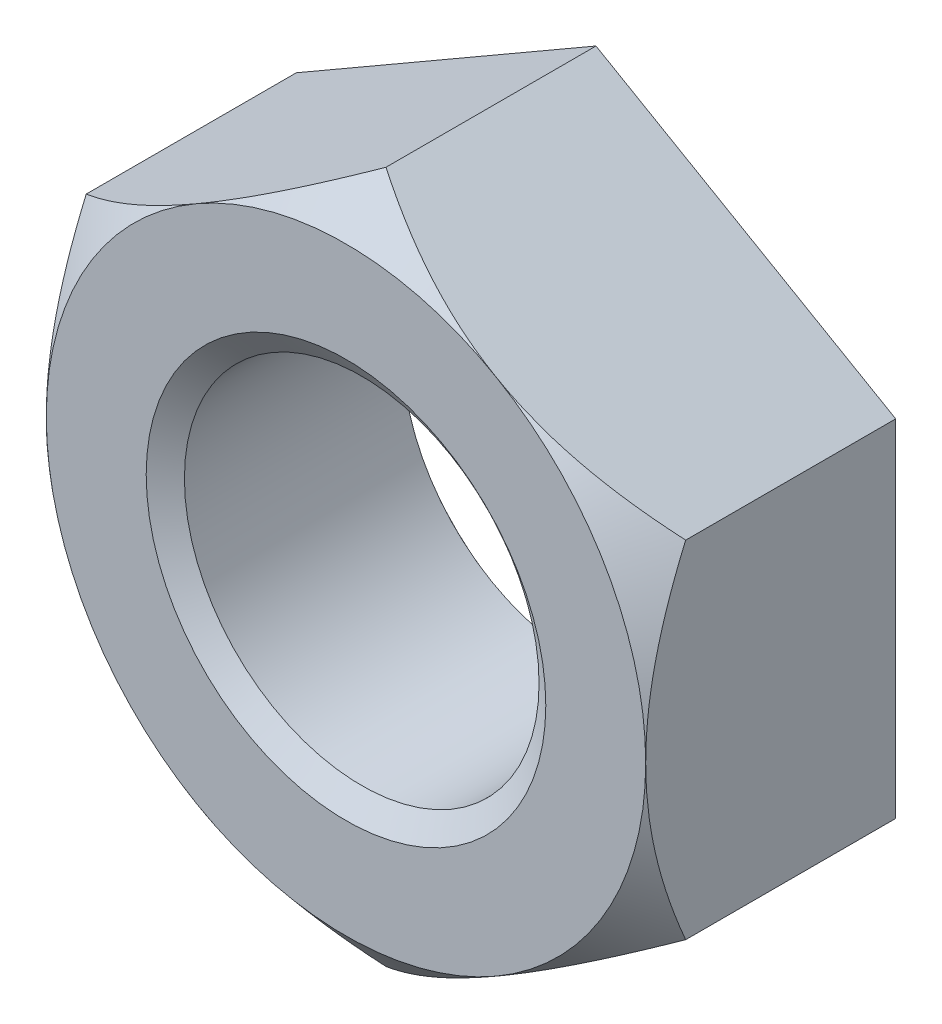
ISO-10303-21;
HEADER;
FILE_DESCRIPTION(('STEP AP214'),'2;1');
FILE_NAME('part.step','',(''),(''),'','','');
FILE_SCHEMA(('AUTOMOTIVE_DESIGN { 1 0 10303 214 1 1 1 1 }'));
ENDSEC;
DATA;
#1=APPLICATION_CONTEXT('core data for automotive mechanical design processes');
#2=APPLICATION_PROTOCOL_DEFINITION('international standard','automotive_design',2000,#1);
#3=PRODUCT_CONTEXT('',#1,'mechanical');
#4=PRODUCT('Part','Part','',(#3));
#5=PRODUCT_RELATED_PRODUCT_CATEGORY('part','',(#4));
#6=PRODUCT_DEFINITION_FORMATION('','',#4);
#7=PRODUCT_DEFINITION_CONTEXT('part definition',#1,'design');
#8=PRODUCT_DEFINITION('design','',#6,#7);
#9=PRODUCT_DEFINITION_SHAPE('','',#8);
#10=(LENGTH_UNIT() NAMED_UNIT(*) SI_UNIT(.MILLI.,.METRE.));
#11=(NAMED_UNIT(*) PLANE_ANGLE_UNIT() SI_UNIT($,.RADIAN.));
#12=(NAMED_UNIT(*) SI_UNIT($,.STERADIAN.) SOLID_ANGLE_UNIT());
#13=UNCERTAINTY_MEASURE_WITH_UNIT(LENGTH_MEASURE(1.E-05),#10,'distance_accuracy_value','');
#14=(GEOMETRIC_REPRESENTATION_CONTEXT(3) GLOBAL_UNCERTAINTY_ASSIGNED_CONTEXT((#13)) GLOBAL_UNIT_ASSIGNED_CONTEXT((#10,
#11,#12)) REPRESENTATION_CONTEXT('',''));
#15=CARTESIAN_POINT('',(0.,0.,0.));
#16=DIRECTION('',(0.,0.,1.));
#17=DIRECTION('',(1.,0.,0.));
#18=AXIS2_PLACEMENT_3D('',#15,#16,#17);
#19=CARTESIAN_POINT('',(0.,0.,-19.8628));
#20=DIRECTION('',(0.,0.,1.));
#21=DIRECTION('',(1.,0.,0.));
#22=AXIS2_PLACEMENT_3D('',#19,#20,#21);
#23=CYLINDRICAL_SURFACE('',#22,14.08938);
#24=CARTESIAN_POINT('',(0.,0.,-1.25030458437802));
#25=DIRECTION('',(0.,0.,1.));
#26=DIRECTION('',(1.,0.,0.));
#27=AXIS2_PLACEMENT_3D('',#24,#25,#26);
#28=CIRCLE('',#27,14.08938);
#29=CARTESIAN_POINT('',(14.08938,0.,-1.25030458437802));
#30=VERTEX_POINT('',#29);
#31=EDGE_CURVE('E131',#30,#30,#28,.F.);
#32=ORIENTED_EDGE('',*,*,#31,.F.);
#33=EDGE_LOOP('',(#32));
#34=FACE_BOUND('',#33,.T.);
#35=CARTESIAN_POINT('',(0.,0.,-18.587095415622));
#36=DIRECTION('',(0.,0.,-1.));
#37=DIRECTION('',(-1.,0.,0.));
#38=AXIS2_PLACEMENT_3D('',#35,#36,#37);
#39=CIRCLE('',#38,14.08938);
#40=CARTESIAN_POINT('',(-14.08938,0.,-18.587095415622));
#41=VERTEX_POINT('',#40);
#42=EDGE_CURVE('E38',#41,#41,#39,.F.);
#43=ORIENTED_EDGE('',*,*,#42,.F.);
#44=EDGE_LOOP('',(#43));
#45=FACE_BOUND('',#44,.T.);
#46=ADVANCED_FACE('F33',(#34,#45),#23,.F.);
#47=CARTESIAN_POINT('',(-47.625,0.,-19.8628));
#48=DIRECTION('',(0.,0.,1.));
#49=DIRECTION('',(1.,0.,0.));
#50=AXIS2_PLACEMENT_3D('',#47,#48,#49);
#51=PLANE('',#50);
#52=DIRECTION('',(-0.866025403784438,-0.500000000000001,0.));
#53=VECTOR('',#52,1.);
#54=CARTESIAN_POINT('',(0.,27.4963065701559,-19.8628));
#55=LINE('',#54,#53);
#56=CARTESIAN_POINT('',(0.,27.4963065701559,-19.8628));
#57=VERTEX_POINT('',#56);
#58=CARTESIAN_POINT('',(-23.8125,13.7481532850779,-19.8628));
#59=VERTEX_POINT('',#58);
#60=EDGE_CURVE('E140',#57,#59,#55,.T.);
#61=ORIENTED_EDGE('',*,*,#60,.F.);
#62=DIRECTION('',(-0.866025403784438,0.500000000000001,0.));
#63=VECTOR('',#62,1.);
#64=CARTESIAN_POINT('',(23.8125,13.7481532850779,-19.8628));
#65=LINE('',#64,#63);
#66=CARTESIAN_POINT('',(23.8125,13.7481532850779,-19.8628));
#67=VERTEX_POINT('',#66);
#68=EDGE_CURVE('E234',#67,#57,#65,.T.);
#69=ORIENTED_EDGE('',*,*,#68,.F.);
#70=DIRECTION('',(0.,-1.,0.));
#71=VECTOR('',#70,1.);
#72=CARTESIAN_POINT('',(23.8125,13.7481532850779,-19.8628));
#73=LINE('',#72,#71);
#74=CARTESIAN_POINT('',(23.8125,-13.748153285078,-19.8628));
#75=VERTEX_POINT('',#74);
#76=EDGE_CURVE('E396',#67,#75,#73,.T.);
#77=ORIENTED_EDGE('',*,*,#76,.T.);
#78=DIRECTION('',(0.866025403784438,0.500000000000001,0.));
#79=VECTOR('',#78,1.);
#80=CARTESIAN_POINT('',(0.,-27.496306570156,-19.8628));
#81=LINE('',#80,#79);
#82=CARTESIAN_POINT('',(0.,-27.496306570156,-19.8628));
#83=VERTEX_POINT('',#82);
#84=EDGE_CURVE('E394',#83,#75,#81,.T.);
#85=ORIENTED_EDGE('',*,*,#84,.F.);
#86=DIRECTION('',(0.866025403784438,-0.500000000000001,0.));
#87=VECTOR('',#86,1.);
#88=CARTESIAN_POINT('',(-23.8125,-13.748153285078,-19.8628));
#89=LINE('',#88,#87);
#90=CARTESIAN_POINT('',(-23.8125,-13.748153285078,-19.8628));
#91=VERTEX_POINT('',#90);
#92=EDGE_CURVE('E390',#91,#83,#89,.T.);
#93=ORIENTED_EDGE('',*,*,#92,.F.);
#94=DIRECTION('',(0.,-1.,0.));
#95=VECTOR('',#94,1.);
#96=CARTESIAN_POINT('',(-23.8125,13.7481532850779,-19.8628));
#97=LINE('',#96,#95);
#98=EDGE_CURVE('E142',#59,#91,#97,.T.);
#99=ORIENTED_EDGE('',*,*,#98,.F.);
#100=EDGE_LOOP('',(#61,#69,#77,#85,#93,#99));
#101=FACE_BOUND('',#100,.T.);
#102=CARTESIAN_POINT('',(0.,0.,-19.8628));
#103=DIRECTION('',(0.,0.,1.));
#104=DIRECTION('',(1.,0.,0.));
#105=AXIS2_PLACEMENT_3D('',#102,#103,#104);
#106=CIRCLE('',#105,15.875);
#107=CARTESIAN_POINT('',(15.875,0.,-19.8628));
#108=VERTEX_POINT('',#107);
#109=EDGE_CURVE('E253',#108,#108,#106,.F.);
#110=ORIENTED_EDGE('',*,*,#109,.F.);
#111=EDGE_LOOP('',(#110));
#112=FACE_BOUND('',#111,.T.);
#113=ADVANCED_FACE('F206',(#101,#112),#51,.F.);
#114=CARTESIAN_POINT('',(-47.625,0.,0.));
#115=DIRECTION('',(0.,0.,1.));
#116=DIRECTION('',(1.,0.,0.));
#117=AXIS2_PLACEMENT_3D('',#114,#115,#116);
#118=PLANE('',#117);
#119=CARTESIAN_POINT('',(0.,0.,0.));
#120=DIRECTION('',(0.,0.,1.));
#121=DIRECTION('',(1.,0.,0.));
#122=AXIS2_PLACEMENT_3D('',#119,#120,#121);
#123=CIRCLE('',#122,23.8125);
#124=CARTESIAN_POINT('',(23.8125,0.,0.));
#125=VERTEX_POINT('',#124);
#126=CARTESIAN_POINT('',(11.90625,-20.6222299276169,0.));
#127=VERTEX_POINT('',#126);
#128=EDGE_CURVE('E11',#125,#127,#123,.F.);
#129=ORIENTED_EDGE('',*,*,#128,.F.);
#130=CARTESIAN_POINT('',(0.,0.,0.));
#131=DIRECTION('',(0.,0.,1.));
#132=DIRECTION('',(1.,0.,0.));
#133=AXIS2_PLACEMENT_3D('',#130,#131,#132);
#134=CIRCLE('',#133,23.8125);
#135=CARTESIAN_POINT('',(11.90625,20.6222299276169,0.));
#136=VERTEX_POINT('',#135);
#137=EDGE_CURVE('E123',#125,#136,#134,.T.);
#138=ORIENTED_EDGE('',*,*,#137,.T.);
#139=CARTESIAN_POINT('',(-11.90625,20.6222299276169,0.));
#140=VERTEX_POINT('',#139);
#141=EDGE_CURVE('E45',#140,#136,#123,.F.);
#142=ORIENTED_EDGE('',*,*,#141,.F.);
#143=CARTESIAN_POINT('',(-23.8125,0.,0.));
#144=VERTEX_POINT('',#143);
#145=EDGE_CURVE('E236',#144,#140,#123,.F.);
#146=ORIENTED_EDGE('',*,*,#145,.F.);
#147=CARTESIAN_POINT('',(-11.90625,-20.6222299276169,0.));
#148=VERTEX_POINT('',#147);
#149=EDGE_CURVE('E382',#148,#144,#123,.F.);
#150=ORIENTED_EDGE('',*,*,#149,.F.);
#151=EDGE_CURVE('E43',#127,#148,#123,.F.);
#152=ORIENTED_EDGE('',*,*,#151,.F.);
#153=EDGE_LOOP('',(#129,#138,#142,#146,#150,#152));
#154=FACE_BOUND('',#153,.T.);
#155=CARTESIAN_POINT('',(0.,0.,0.));
#156=DIRECTION('',(0.,0.,1.));
#157=DIRECTION('',(1.,0.,0.));
#158=AXIS2_PLACEMENT_3D('',#155,#156,#157);
#159=CIRCLE('',#158,15.875);
#160=CARTESIAN_POINT('',(15.875,0.,0.));
#161=VERTEX_POINT('',#160);
#162=EDGE_CURVE('E252',#161,#161,#159,.T.);
#163=ORIENTED_EDGE('',*,*,#162,.F.);
#164=EDGE_LOOP('',(#163));
#165=FACE_BOUND('',#164,.T.);
#166=ADVANCED_FACE('F133',(#154,#165),#118,.T.);
#167=CARTESIAN_POINT('',(0.,27.4963065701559,-19.8628));
#168=DIRECTION('',(-0.500000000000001,0.866025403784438,0.));
#169=DIRECTION('',(-0.866025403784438,-0.500000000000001,0.));
#170=AXIS2_PLACEMENT_3D('',#167,#168,#169);
#171=PLANE('',#170);
#172=CARTESIAN_POINT('',(0.000200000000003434,27.4964220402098,-3.17509952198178));
#173=CARTESIAN_POINT('',(-0.466718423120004,27.2268465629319,-2.94279478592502));
#174=CARTESIAN_POINT('',(-0.936923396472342,26.9553735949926,-2.71902576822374));
#175=CARTESIAN_POINT('',(-1.88435346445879,26.4083745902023,-2.29132084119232));
#176=CARTESIAN_POINT('',(-2.36158251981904,26.1328462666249,-2.08739665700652));
#177=CARTESIAN_POINT('',(-3.32539928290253,25.5763863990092,-1.70144583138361));
#178=CARTESIAN_POINT('',(-3.81202219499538,25.2954345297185,-1.51953557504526));
#179=CARTESIAN_POINT('',(-4.79203527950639,24.7296237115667,-1.18210790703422));
#180=CARTESIAN_POINT('',(-5.28542430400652,24.4447654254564,-1.02658607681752));
#181=CARTESIAN_POINT('',(-6.26966313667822,23.8765148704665,-0.7477322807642));
#182=CARTESIAN_POINT('',(-6.76040037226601,23.5931875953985,-0.623874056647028));
#183=CARTESIAN_POINT('',(-7.74712449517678,23.0235021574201,-0.40776440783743));
#184=CARTESIAN_POINT('',(-8.2431115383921,22.7371439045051,-0.315513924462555));
#185=CARTESIAN_POINT('',(-9.23788424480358,22.162811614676,-0.165323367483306));
#186=CARTESIAN_POINT('',(-9.73666132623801,21.8748425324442,-0.107308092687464));
#187=CARTESIAN_POINT('',(-10.7363624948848,21.2976647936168,-0.0270201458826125));
#188=CARTESIAN_POINT('',(-11.2372864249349,21.0084562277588,-0.00474490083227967));
#189=CARTESIAN_POINT('',(-12.1693710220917,20.4703169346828,0.00281628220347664));
#190=CARTESIAN_POINT('',(-12.6005077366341,20.2214000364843,-0.00716781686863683));
#191=CARTESIAN_POINT('',(-13.4616806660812,19.7242016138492,-0.0538480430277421));
#192=CARTESIAN_POINT('',(-13.8917169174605,19.475920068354,-0.0905432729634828));
#193=CARTESIAN_POINT('',(-14.7498446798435,18.9804797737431,-0.189848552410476));
#194=CARTESIAN_POINT('',(-15.1779345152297,18.7333219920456,-0.252477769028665));
#195=CARTESIAN_POINT('',(-16.0308619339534,18.2408841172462,-0.402307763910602));
#196=CARTESIAN_POINT('',(-16.4556994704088,17.9956040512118,-0.489508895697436));
#197=CARTESIAN_POINT('',(-17.3014196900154,17.5073272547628,-0.68679156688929));
#198=CARTESIAN_POINT('',(-17.7223017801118,17.2643308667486,-0.796876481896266));
#199=CARTESIAN_POINT('',(-18.5595580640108,16.7809407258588,-1.03800894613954));
#200=CARTESIAN_POINT('',(-18.9759315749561,16.5405473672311,-1.16905962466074));
#201=CARTESIAN_POINT('',(-20.2173718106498,15.8238015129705,-1.59051649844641));
#202=CARTESIAN_POINT('',(-21.0352961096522,15.3515726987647,-1.90935780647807));
#203=CARTESIAN_POINT('',(-22.1750858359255,14.6935147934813,-2.40175395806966));
#204=CARTESIAN_POINT('',(-22.5053698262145,14.5028252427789,-2.55026732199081));
#205=CARTESIAN_POINT('',(-23.1618377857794,14.1238132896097,-2.85617837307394));
#206=CARTESIAN_POINT('',(-23.4880302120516,13.9354860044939,-3.01355183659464));
#207=CARTESIAN_POINT('',(-23.8127,13.7480378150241,-3.17509952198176));
#208=B_SPLINE_CURVE_WITH_KNOTS('',3,(#172,#173,#174,#175,#176,#177,#178,#179,#180,#181,#182,
#183,#184,#185,#186,#187,#188,#189,#190,#191,#192,#193,#194,#195,#196,#197,#198,#199,#200,#201,
#202,#203,#204,#205,#206,#207),.UNSPECIFIED.,.F.,.F.,(4,2,2,2,2,2,2,2,2,2,2,2,2,2,2,2,2,4),(0.,
1.76129137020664,3.52361714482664,5.29488693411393,7.06585984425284,8.8051396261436,
10.5444712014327,12.2799677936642,14.0153394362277,15.5084329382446,17.0014762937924,
18.4956250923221,19.9897953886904,21.4841862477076,22.9788003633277,25.966130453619,
27.1938911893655,28.4184444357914),.UNSPECIFIED.);
#209=CARTESIAN_POINT('',(0.,27.4963065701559,-3.175));
#210=VERTEX_POINT('',#209);
#211=EDGE_CURVE('E184',#210,#140,#208,.T.);
#212=ORIENTED_EDGE('',*,*,#211,.F.);
#213=DIRECTION('',(0.,0.,1.));
#214=VECTOR('',#213,1.);
#215=CARTESIAN_POINT('',(0.,27.4963065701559,-19.8628));
#216=LINE('',#215,#214);
#217=EDGE_CURVE('E227',#57,#210,#216,.T.);
#218=ORIENTED_EDGE('',*,*,#217,.F.);
#219=ORIENTED_EDGE('',*,*,#60,.T.);
#220=DIRECTION('',(0.,0.,1.));
#221=VECTOR('',#220,1.);
#222=CARTESIAN_POINT('',(-23.8125,13.7481532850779,-19.8628));
#223=LINE('',#222,#221);
#224=CARTESIAN_POINT('',(-23.8125,13.748153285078,-3.175));
#225=VERTEX_POINT('',#224);
#226=EDGE_CURVE('E249',#59,#225,#223,.T.);
#227=ORIENTED_EDGE('',*,*,#226,.T.);
#228=EDGE_CURVE('E179',#140,#225,#208,.T.);
#229=ORIENTED_EDGE('',*,*,#228,.F.);
#230=EDGE_LOOP('',(#212,#218,#219,#227,#229));
#231=FACE_BOUND('',#230,.T.);
#232=ADVANCED_FACE('F35',(#231),#171,.T.);
#233=CARTESIAN_POINT('',(23.8125,13.7481532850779,-19.8628));
#234=DIRECTION('',(0.500000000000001,0.866025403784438,0.));
#235=DIRECTION('',(-0.866025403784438,0.500000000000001,0.));
#236=AXIS2_PLACEMENT_3D('',#233,#234,#235);
#237=PLANE('',#236);
#238=CARTESIAN_POINT('',(23.8127,13.7480378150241,-3.17509952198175));
#239=CARTESIAN_POINT('',(23.34578157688,14.017613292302,-2.942794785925));
#240=CARTESIAN_POINT('',(22.8755766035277,14.2890862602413,-2.71902576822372));
#241=CARTESIAN_POINT('',(21.9281465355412,14.8360852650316,-2.29132084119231));
#242=CARTESIAN_POINT('',(21.450917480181,15.111613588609,-2.0873966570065));
#243=CARTESIAN_POINT('',(20.4871007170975,15.6680734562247,-1.7014458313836));
#244=CARTESIAN_POINT('',(20.0004778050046,15.9490253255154,-1.51953557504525));
#245=CARTESIAN_POINT('',(19.0204647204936,16.5148361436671,-1.18210790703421));
#246=CARTESIAN_POINT('',(18.5270756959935,16.7996944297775,-1.02658607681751));
#247=CARTESIAN_POINT('',(17.5428368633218,17.3679449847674,-0.74773228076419));
#248=CARTESIAN_POINT('',(17.052099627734,17.6512722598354,-0.623874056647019));
#249=CARTESIAN_POINT('',(16.0653755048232,18.2209576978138,-0.407764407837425));
#250=CARTESIAN_POINT('',(15.5693884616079,18.5073159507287,-0.315513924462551));
#251=CARTESIAN_POINT('',(14.5746157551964,19.0816482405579,-0.165323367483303));
#252=CARTESIAN_POINT('',(14.075838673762,19.3696173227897,-0.107308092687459));
#253=CARTESIAN_POINT('',(13.0761375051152,19.9467950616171,-0.0270201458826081));
#254=CARTESIAN_POINT('',(12.5752135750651,20.2360036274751,-0.00474490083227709));
#255=CARTESIAN_POINT('',(11.6431289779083,20.774142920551,0.00281628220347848));
#256=CARTESIAN_POINT('',(11.2119922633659,21.0230598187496,-0.00716781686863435));
#257=CARTESIAN_POINT('',(10.3508193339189,21.5202582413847,-0.0538480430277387));
#258=CARTESIAN_POINT('',(9.92078308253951,21.7685397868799,-0.0905432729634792));
#259=CARTESIAN_POINT('',(9.06265532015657,22.2639800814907,-0.18984855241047));
#260=CARTESIAN_POINT('',(8.63456548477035,22.5111378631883,-0.252477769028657));
#261=CARTESIAN_POINT('',(7.78163806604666,23.0035757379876,-0.402307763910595));
#262=CARTESIAN_POINT('',(7.35680052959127,23.248855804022,-0.489508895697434));
#263=CARTESIAN_POINT('',(6.51108030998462,23.737132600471,-0.686791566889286));
#264=CARTESIAN_POINT('',(6.09019821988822,23.9801289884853,-0.796876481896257));
#265=CARTESIAN_POINT('',(5.25294193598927,24.4635191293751,-1.03800894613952));
#266=CARTESIAN_POINT('',(4.83656842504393,24.7039124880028,-1.16905962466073));
#267=CARTESIAN_POINT('',(3.59512818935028,25.4206583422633,-1.5905164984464));
#268=CARTESIAN_POINT('',(2.77720389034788,25.8928871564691,-1.90935780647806));
#269=CARTESIAN_POINT('',(1.63741416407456,26.5509450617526,-2.40175395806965));
#270=CARTESIAN_POINT('',(1.30713017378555,26.741634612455,-2.55026732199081));
#271=CARTESIAN_POINT('',(0.650662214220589,27.1206465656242,-2.85617837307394));
#272=CARTESIAN_POINT('',(0.324469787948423,27.30897385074,-3.01355183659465));
#273=CARTESIAN_POINT('',(-0.000199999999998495,27.4964220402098,-3.17509952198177));
#274=B_SPLINE_CURVE_WITH_KNOTS('',3,(#238,#239,#240,#241,#242,#243,#244,#245,#246,#247,#248,
#249,#250,#251,#252,#253,#254,#255,#256,#257,#258,#259,#260,#261,#262,#263,#264,#265,#266,#267,
#268,#269,#270,#271,#272,#273),.UNSPECIFIED.,.F.,.F.,(4,2,2,2,2,2,2,2,2,2,2,2,2,2,2,2,2,4),(0.,
1.76129137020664,3.52361714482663,5.29488693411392,7.06585984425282,8.80513962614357,
10.5444712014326,12.2799677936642,14.0153394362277,15.5084329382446,17.0014762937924,
18.4956250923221,19.9897953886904,21.4841862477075,22.9788003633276,25.9661304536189,
27.1938911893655,28.4184444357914),.UNSPECIFIED.);
#275=CARTESIAN_POINT('',(23.8125,13.748153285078,-3.175));
#276=VERTEX_POINT('',#275);
#277=EDGE_CURVE('E126',#276,#136,#274,.T.);
#278=ORIENTED_EDGE('',*,*,#277,.F.);
#279=DIRECTION('',(0.,0.,1.));
#280=VECTOR('',#279,1.);
#281=CARTESIAN_POINT('',(23.8125,13.7481532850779,-19.8628));
#282=LINE('',#281,#280);
#283=EDGE_CURVE('E139',#67,#276,#282,.T.);
#284=ORIENTED_EDGE('',*,*,#283,.F.);
#285=ORIENTED_EDGE('',*,*,#68,.T.);
#286=ORIENTED_EDGE('',*,*,#217,.T.);
#287=EDGE_CURVE('E150',#136,#210,#274,.T.);
#288=ORIENTED_EDGE('',*,*,#287,.F.);
#289=EDGE_LOOP('',(#278,#284,#285,#286,#288));
#290=FACE_BOUND('',#289,.T.);
#291=ADVANCED_FACE('F165',(#290),#237,.T.);
#292=CARTESIAN_POINT('',(23.8125,13.7481532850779,-19.8628));
#293=DIRECTION('',(-1.,0.,0.));
#294=DIRECTION('',(0.,0.,1.));
#295=AXIS2_PLACEMENT_3D('',#292,#293,#294);
#296=PLANE('',#295);
#297=ORIENTED_EDGE('',*,*,#283,.T.);
#298=CARTESIAN_POINT('',(23.8125,-30.4323844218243,-12.7808178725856));
#299=CARTESIAN_POINT('',(23.8125,-30.0474390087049,-12.5195293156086));
#300=CARTESIAN_POINT('',(23.8125,-29.6616238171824,-12.2595230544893));
#301=CARTESIAN_POINT('',(23.8125,-28.8881005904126,-11.7423291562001));
#302=CARTESIAN_POINT('',(23.8125,-28.5003925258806,-11.4851415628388));
#303=CARTESIAN_POINT('',(23.8125,-27.3340565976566,-10.718094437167));
#304=CARTESIAN_POINT('',(23.8125,-26.5523757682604,-10.2128586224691));
#305=CARTESIAN_POINT('',(23.8125,-24.9739677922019,-9.21378302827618));
#306=CARTESIAN_POINT('',(23.8125,-24.1771732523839,-8.72004948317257));
#307=CARTESIAN_POINT('',(23.8125,-22.5724061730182,-7.75115027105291));
#308=CARTESIAN_POINT('',(23.8125,-21.7644343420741,-7.27598343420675));
#309=CARTESIAN_POINT('',(23.8125,-20.0912004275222,-6.32339637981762));
#310=CARTESIAN_POINT('',(23.8125,-19.2252082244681,-5.84725230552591));
#311=CARTESIAN_POINT('',(23.8125,-17.4760714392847,-4.92703111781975));
#312=CARTESIAN_POINT('',(23.8125,-16.5929243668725,-4.48295870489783));
#313=CARTESIAN_POINT('',(23.8125,-14.809519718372,-3.63687523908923));
#314=CARTESIAN_POINT('',(23.8125,-13.909315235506,-3.2347530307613));
#315=CARTESIAN_POINT('',(23.8125,-12.0875146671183,-2.48245763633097));
#316=CARTESIAN_POINT('',(23.8125,-11.165927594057,-2.13226300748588));
#317=CARTESIAN_POINT('',(23.8125,-9.77991549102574,-1.66062210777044));
#318=CARTESIAN_POINT('',(23.8125,-9.32396739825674,-1.51411347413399));
#319=CARTESIAN_POINT('',(23.8125,-8.4068690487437,-1.23832850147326));
#320=CARTESIAN_POINT('',(23.8125,-7.94571894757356,-1.10905164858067));
#321=CARTESIAN_POINT('',(23.8125,-7.01845829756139,-0.86948852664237));
#322=CARTESIAN_POINT('',(23.8125,-6.55234739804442,-0.759203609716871));
#323=CARTESIAN_POINT('',(23.8125,-5.61570737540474,-0.559369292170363));
#324=CARTESIAN_POINT('',(23.8125,-5.14517852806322,-0.469818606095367));
#325=CARTESIAN_POINT('',(23.8125,-4.20918018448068,-0.314477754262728));
#326=CARTESIAN_POINT('',(23.8125,-3.74377915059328,-0.248276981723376));
#327=CARTESIAN_POINT('',(23.8125,-2.81029538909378,-0.138591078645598));
#328=CARTESIAN_POINT('',(23.8125,-2.3422126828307,-0.0951057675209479));
#329=CARTESIAN_POINT('',(23.8125,-1.40448447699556,-0.0317203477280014));
#330=CARTESIAN_POINT('',(23.8125,-0.934839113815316,-0.0118182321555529));
#331=CARTESIAN_POINT('',(23.8125,0.00485402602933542,0.00399308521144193));
#332=CARTESIAN_POINT('',(23.8125,0.474901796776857,-9.7366072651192E-05));
#333=CARTESIAN_POINT('',(23.8125,1.38277005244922,-0.0311081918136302));
#334=CARTESIAN_POINT('',(23.8125,1.82064434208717,-0.0564841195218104));
#335=CARTESIAN_POINT('',(23.8125,2.69472474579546,-0.127591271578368));
#336=CARTESIAN_POINT('',(23.8125,3.13093088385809,-0.173322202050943));
#337=CARTESIAN_POINT('',(23.8125,4.00085005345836,-0.284359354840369));
#338=CARTESIAN_POINT('',(23.8125,4.43456297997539,-0.349666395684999));
#339=CARTESIAN_POINT('',(23.8125,5.29878073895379,-0.498811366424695));
#340=CARTESIAN_POINT('',(23.8125,5.72928553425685,-0.58264951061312));
#341=CARTESIAN_POINT('',(23.8125,6.59545086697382,-0.76955330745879));
#342=CARTESIAN_POINT('',(23.8125,7.03103272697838,-0.872982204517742));
#343=CARTESIAN_POINT('',(23.8125,7.89789688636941,-1.09646126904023));
#344=CARTESIAN_POINT('',(23.8125,8.32917914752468,-1.21651158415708));
#345=CARTESIAN_POINT('',(23.8125,9.18710428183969,-1.47175458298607));
#346=CARTESIAN_POINT('',(23.8125,9.61374832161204,-1.6069433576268));
#347=CARTESIAN_POINT('',(23.8125,10.4623987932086,-1.89106533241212));
#348=CARTESIAN_POINT('',(23.8125,10.8844053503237,-2.03999816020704));
#349=CARTESIAN_POINT('',(23.8125,12.0723898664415,-2.47908631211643));
#350=CARTESIAN_POINT('',(23.8125,12.8330028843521,-2.78381459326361));
#351=CARTESIAN_POINT('',(23.8125,14.3397528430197,-3.42737144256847));
#352=CARTESIAN_POINT('',(23.8125,15.085885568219,-3.76620976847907));
#353=CARTESIAN_POINT('',(23.8125,16.5656183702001,-4.47211487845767));
#354=CARTESIAN_POINT('',(23.8125,17.2992037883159,-4.83921224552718));
#355=CARTESIAN_POINT('',(23.8125,18.7543705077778,-5.59621376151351));
#356=CARTESIAN_POINT('',(23.8125,19.4759528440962,-5.9861159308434));
#357=CARTESIAN_POINT('',(23.8125,20.9129364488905,-6.78712116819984));
#358=CARTESIAN_POINT('',(23.8125,21.6282740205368,-7.19833810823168));
#359=CARTESIAN_POINT('',(23.8125,23.0496605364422,-8.03650642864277));
#360=CARTESIAN_POINT('',(23.8125,23.7557093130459,-8.46345809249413));
#361=CARTESIAN_POINT('',(23.8125,25.159303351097,-9.33022426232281));
#362=CARTESIAN_POINT('',(23.8125,25.8568531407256,-9.77003145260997));
#363=CARTESIAN_POINT('',(23.8125,27.2448815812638,-10.6606333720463));
#364=CARTESIAN_POINT('',(23.8125,27.9353602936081,-11.1114280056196));
#365=CARTESIAN_POINT('',(23.8125,29.2422431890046,-11.9773285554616));
#366=CARTESIAN_POINT('',(23.8125,29.8592270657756,-12.3915611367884));
#367=CARTESIAN_POINT('',(23.8125,31.0887545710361,-13.2265724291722));
#368=CARTESIAN_POINT('',(23.8125,31.7012981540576,-13.6473512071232));
#369=CARTESIAN_POINT('',(23.8125,32.9225100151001,-14.4946567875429));
#370=CARTESIAN_POINT('',(23.8125,33.5311777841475,-14.9211843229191));
#371=CARTESIAN_POINT('',(23.8125,34.7449895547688,-15.7792251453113));
#372=CARTESIAN_POINT('',(23.8125,35.3501335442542,-16.2107384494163));
#373=CARTESIAN_POINT('',(23.8125,36.5492875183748,-17.0724138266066));
#374=CARTESIAN_POINT('',(23.8125,37.1433389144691,-17.5025183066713));
#375=CARTESIAN_POINT('',(23.8125,38.3286863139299,-18.3665082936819));
#376=CARTESIAN_POINT('',(23.8125,38.9199823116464,-18.8003938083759));
#377=CARTESIAN_POINT('',(23.8125,40.0999391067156,-19.6714092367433));
#378=CARTESIAN_POINT('',(23.8125,40.6886005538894,-20.1085382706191));
#379=CARTESIAN_POINT('',(23.8125,41.8636728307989,-20.9857993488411));
#380=CARTESIAN_POINT('',(23.8125,42.4500836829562,-21.425931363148));
#381=CARTESIAN_POINT('',(23.8125,43.0354894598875,-21.8673923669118));
#382=B_SPLINE_CURVE_WITH_KNOTS('',3,(#298,#299,#300,#301,#302,#303,#304,#305,#306,#307,#308,
#309,#310,#311,#312,#313,#314,#315,#316,#317,#318,#319,#320,#321,#322,#323,#324,#325,#326,#327,
#328,#329,#330,#331,#332,#333,#334,#335,#336,#337,#338,#339,#340,#341,#342,#343,#344,#345,#346,
#347,#348,#349,#350,#351,#352,#353,#354,#355,#356,#357,#358,#359,#360,#361,#362,#363,#364,#365,
#366,#367,#368,#369,#370,#371,#372,#373,#374,#375,#376,#377,#378,#379,#380,#381),.UNSPECIFIED.,
.F.,.F.,(4,2,2,2,2,2,2,2,2,2,2,2,2,2,2,2,2,2,2,2,2,2,2,2,2,2,2,2,2,2,2,2,2,2,2,2,2,2,2,2,2,4),
(0.,1.39573592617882,2.79149351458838,5.58358479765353,8.3954779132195,11.2071935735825,
14.1714415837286,17.1361231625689,20.0927382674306,23.0481290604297,24.4845779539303,
25.9209840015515,27.3574922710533,28.7939114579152,30.2036384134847,31.6133541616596,
33.0229499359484,34.4325253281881,35.7478714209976,37.0631985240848,38.3785806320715,
39.6939779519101,41.036700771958,42.3794355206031,43.7218243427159,45.0641768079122,
47.5212119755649,49.9789520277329,52.4393903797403,54.8996154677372,57.3747067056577,
59.8498425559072,62.3235962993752,64.7973285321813,67.0267035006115,69.2561012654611,
71.4857859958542,73.7154783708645,75.9156850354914,78.1158962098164,80.3155309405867,
82.5151437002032),.UNSPECIFIED.);
#383=EDGE_CURVE('E118',#276,#125,#382,.F.);
#384=ORIENTED_EDGE('',*,*,#383,.T.);
#385=CARTESIAN_POINT('',(23.8125,-13.748153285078,-3.175));
#386=VERTEX_POINT('',#385);
#387=EDGE_CURVE('E107',#125,#386,#382,.F.);
#388=ORIENTED_EDGE('',*,*,#387,.T.);
#389=DIRECTION('',(0.,0.,1.));
#390=VECTOR('',#389,1.);
#391=CARTESIAN_POINT('',(23.8125,-13.748153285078,-19.8628));
#392=LINE('',#391,#390);
#393=EDGE_CURVE('E237',#75,#386,#392,.T.);
#394=ORIENTED_EDGE('',*,*,#393,.F.);
#395=ORIENTED_EDGE('',*,*,#76,.F.);
#396=EDGE_LOOP('',(#297,#384,#388,#394,#395));
#397=FACE_BOUND('',#396,.T.);
#398=ADVANCED_FACE('F137',(#397),#296,.F.);
#399=CARTESIAN_POINT('',(0.,-27.496306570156,-19.8628));
#400=DIRECTION('',(0.500000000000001,-0.866025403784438,0.));
#401=DIRECTION('',(0.866025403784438,0.500000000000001,0.));
#402=AXIS2_PLACEMENT_3D('',#399,#400,#401);
#403=PLANE('',#402);
#404=CARTESIAN_POINT('',(-0.000200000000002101,-27.4964220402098,-3.17509952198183));
#405=CARTESIAN_POINT('',(0.466718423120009,-27.2268465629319,-2.94279478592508));
#406=CARTESIAN_POINT('',(0.936923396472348,-26.9553735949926,-2.7190257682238));
#407=CARTESIAN_POINT('',(1.8843534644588,-26.4083745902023,-2.29132084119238));
#408=CARTESIAN_POINT('',(2.36158251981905,-26.132846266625,-2.08739665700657));
#409=CARTESIAN_POINT('',(3.32539928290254,-25.5763863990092,-1.70144583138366));
#410=CARTESIAN_POINT('',(3.81202219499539,-25.2954345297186,-1.51953557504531));
#411=CARTESIAN_POINT('',(4.79203527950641,-24.7296237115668,-1.18210790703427));
#412=CARTESIAN_POINT('',(5.28542430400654,-24.4447654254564,-1.02658607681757));
#413=CARTESIAN_POINT('',(6.26966313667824,-23.8765148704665,-0.747732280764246));
#414=CARTESIAN_POINT('',(6.76040037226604,-23.5931875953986,-0.623874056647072));
#415=CARTESIAN_POINT('',(7.74712449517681,-23.0235021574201,-0.407764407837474));
#416=CARTESIAN_POINT('',(8.24311153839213,-22.7371439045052,-0.315513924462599));
#417=CARTESIAN_POINT('',(9.23788424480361,-22.162811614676,-0.165323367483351));
#418=CARTESIAN_POINT('',(9.73666132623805,-21.8748425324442,-0.107308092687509));
#419=CARTESIAN_POINT('',(10.7363624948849,-21.2976647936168,-0.0270201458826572));
#420=CARTESIAN_POINT('',(11.237286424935,-21.0084562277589,-0.0047449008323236));
#421=CARTESIAN_POINT('',(12.1693710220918,-20.4703169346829,0.00281628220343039));
#422=CARTESIAN_POINT('',(12.6005077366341,-20.2214000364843,-0.00716781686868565));
#423=CARTESIAN_POINT('',(13.4616806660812,-19.7242016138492,-0.0538480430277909));
#424=CARTESIAN_POINT('',(13.8917169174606,-19.475920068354,-0.0905432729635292));
#425=CARTESIAN_POINT('',(14.7498446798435,-18.9804797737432,-0.18984855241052));
#426=CARTESIAN_POINT('',(15.1779345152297,-18.7333219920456,-0.252477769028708));
#427=CARTESIAN_POINT('',(16.0308619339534,-18.2408841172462,-0.402307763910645));
#428=CARTESIAN_POINT('',(16.4556994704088,-17.9956040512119,-0.48950889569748));
#429=CARTESIAN_POINT('',(17.3014196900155,-17.5073272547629,-0.686791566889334));
#430=CARTESIAN_POINT('',(17.7223017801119,-17.2643308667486,-0.796876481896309));
#431=CARTESIAN_POINT('',(18.5595580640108,-16.7809407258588,-1.03800894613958));
#432=CARTESIAN_POINT('',(18.9759315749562,-16.5405473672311,-1.16905962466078));
#433=CARTESIAN_POINT('',(20.2173718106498,-15.8238015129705,-1.59051649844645));
#434=CARTESIAN_POINT('',(21.0352961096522,-15.3515726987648,-1.90935780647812));
#435=CARTESIAN_POINT('',(22.1750858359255,-14.6935147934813,-2.4017539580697));
#436=CARTESIAN_POINT('',(22.5053698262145,-14.5028252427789,-2.55026732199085));
#437=CARTESIAN_POINT('',(23.1618377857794,-14.1238132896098,-2.85617837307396));
#438=CARTESIAN_POINT('',(23.4880302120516,-13.9354860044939,-3.01355183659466));
#439=CARTESIAN_POINT('',(23.8127,-13.7480378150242,-3.17509952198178));
#440=B_SPLINE_CURVE_WITH_KNOTS('',3,(#404,#405,#406,#407,#408,#409,#410,#411,#412,#413,#414,
#415,#416,#417,#418,#419,#420,#421,#422,#423,#424,#425,#426,#427,#428,#429,#430,#431,#432,#433,
#434,#435,#436,#437,#438,#439),.UNSPECIFIED.,.F.,.F.,(4,2,2,2,2,2,2,2,2,2,2,2,2,2,2,2,2,4),(0.,
1.76129137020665,3.52361714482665,5.29488693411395,7.06585984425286,8.80513962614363,
10.5444712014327,12.2799677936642,14.0153394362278,15.5084329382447,17.0014762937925,
18.4956250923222,19.9897953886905,21.4841862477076,22.9788003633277,25.966130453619,
27.1938911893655,28.4184444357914),.UNSPECIFIED.);
#441=CARTESIAN_POINT('',(-1.2490009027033E-13,-27.4963065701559,-3.175));
#442=VERTEX_POINT('',#441);
#443=EDGE_CURVE('E52',#442,#127,#440,.T.);
#444=ORIENTED_EDGE('',*,*,#443,.F.);
#445=DIRECTION('',(0.,0.,1.));
#446=VECTOR('',#445,1.);
#447=CARTESIAN_POINT('',(0.,-27.496306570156,-19.8628));
#448=LINE('',#447,#446);
#449=EDGE_CURVE('E243',#83,#442,#448,.T.);
#450=ORIENTED_EDGE('',*,*,#449,.F.);
#451=ORIENTED_EDGE('',*,*,#84,.T.);
#452=ORIENTED_EDGE('',*,*,#393,.T.);
#453=EDGE_CURVE('E113',#127,#386,#440,.T.);
#454=ORIENTED_EDGE('',*,*,#453,.F.);
#455=EDGE_LOOP('',(#444,#450,#451,#452,#454));
#456=FACE_BOUND('',#455,.T.);
#457=ADVANCED_FACE('F164',(#456),#403,.T.);
#458=CARTESIAN_POINT('',(-23.8125,-13.748153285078,-19.8628));
#459=DIRECTION('',(-0.500000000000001,-0.866025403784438,0.));
#460=DIRECTION('',(0.866025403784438,-0.500000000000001,0.));
#461=AXIS2_PLACEMENT_3D('',#458,#459,#460);
#462=PLANE('',#461);
#463=CARTESIAN_POINT('',(-23.8127,-13.7480378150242,-3.17509952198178));
#464=CARTESIAN_POINT('',(-23.34578157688,-14.0176132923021,-2.94279478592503));
#465=CARTESIAN_POINT('',(-22.8755766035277,-14.2890862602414,-2.71902576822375));
#466=CARTESIAN_POINT('',(-21.9281465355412,-14.8360852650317,-2.29132084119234));
#467=CARTESIAN_POINT('',(-21.450917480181,-15.111613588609,-2.08739665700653));
#468=CARTESIAN_POINT('',(-20.4871007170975,-15.6680734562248,-1.70144583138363));
#469=CARTESIAN_POINT('',(-20.0004778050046,-15.9490253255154,-1.51953557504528));
#470=CARTESIAN_POINT('',(-19.0204647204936,-16.5148361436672,-1.18210790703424));
#471=CARTESIAN_POINT('',(-18.5270756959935,-16.7996944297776,-1.02658607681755));
#472=CARTESIAN_POINT('',(-17.5428368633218,-17.3679449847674,-0.747732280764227));
#473=CARTESIAN_POINT('',(-17.052099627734,-17.6512722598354,-0.623874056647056));
#474=CARTESIAN_POINT('',(-16.0653755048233,-18.2209576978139,-0.407764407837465));
#475=CARTESIAN_POINT('',(-15.5693884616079,-18.5073159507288,-0.315513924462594));
#476=CARTESIAN_POINT('',(-14.5746157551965,-19.0816482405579,-0.165323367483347));
#477=CARTESIAN_POINT('',(-14.075838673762,-19.3696173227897,-0.107308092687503));
#478=CARTESIAN_POINT('',(-13.0761375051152,-19.9467950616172,-0.0270201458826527));
#479=CARTESIAN_POINT('',(-12.5752135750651,-20.2360036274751,-0.00474490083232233));
#480=CARTESIAN_POINT('',(-11.6431289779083,-20.7741429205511,0.00281628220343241));
#481=CARTESIAN_POINT('',(-11.211992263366,-21.0230598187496,-0.00716781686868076));
#482=CARTESIAN_POINT('',(-10.3508193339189,-21.5202582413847,-0.0538480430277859));
#483=CARTESIAN_POINT('',(-9.92078308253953,-21.7685397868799,-0.0905432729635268));
#484=CARTESIAN_POINT('',(-9.0626553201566,-22.2639800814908,-0.18984855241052));
#485=CARTESIAN_POINT('',(-8.63456548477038,-22.5111378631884,-0.252477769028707));
#486=CARTESIAN_POINT('',(-7.78163806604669,-23.0035757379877,-0.402307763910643));
#487=CARTESIAN_POINT('',(-7.3568005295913,-23.2488558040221,-0.489508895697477));
#488=CARTESIAN_POINT('',(-6.51108030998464,-23.7371326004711,-0.686791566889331));
#489=CARTESIAN_POINT('',(-6.09019821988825,-23.9801289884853,-0.796876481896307));
#490=CARTESIAN_POINT('',(-5.2529419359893,-24.4635191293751,-1.03800894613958));
#491=CARTESIAN_POINT('',(-4.83656842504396,-24.7039124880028,-1.16905962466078));
#492=CARTESIAN_POINT('',(-3.5951281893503,-25.4206583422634,-1.59051649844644));
#493=CARTESIAN_POINT('',(-2.7772038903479,-25.8928871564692,-1.90935780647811));
#494=CARTESIAN_POINT('',(-1.63741416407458,-26.5509450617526,-2.4017539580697));
#495=CARTESIAN_POINT('',(-1.30713017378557,-26.741634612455,-2.55026732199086));
#496=CARTESIAN_POINT('',(-0.650662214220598,-27.1206465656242,-2.85617837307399));
#497=CARTESIAN_POINT('',(-0.324469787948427,-27.3089738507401,-3.0135518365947));
#498=CARTESIAN_POINT('',(0.00019999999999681,-27.4964220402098,-3.17509952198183));
#499=B_SPLINE_CURVE_WITH_KNOTS('',3,(#463,#464,#465,#466,#467,#468,#469,#470,#471,#472,#473,
#474,#475,#476,#477,#478,#479,#480,#481,#482,#483,#484,#485,#486,#487,#488,#489,#490,#491,#492,
#493,#494,#495,#496,#497,#498),.UNSPECIFIED.,.F.,.F.,(4,2,2,2,2,2,2,2,2,2,2,2,2,2,2,2,2,4),(0.,
1.76129137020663,3.52361714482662,5.29488693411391,7.06585984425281,8.80513962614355,
10.5444712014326,12.2799677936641,14.0153394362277,15.5084329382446,17.0014762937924,
18.495625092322,19.9897953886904,21.4841862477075,22.9788003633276,25.9661304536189,
27.1938911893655,28.4184444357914),.UNSPECIFIED.);
#500=CARTESIAN_POINT('',(-23.8125,-13.748153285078,-3.175));
#501=VERTEX_POINT('',#500);
#502=EDGE_CURVE('E59',#501,#148,#499,.T.);
#503=ORIENTED_EDGE('',*,*,#502,.F.);
#504=DIRECTION('',(0.,0.,1.));
#505=VECTOR('',#504,1.);
#506=CARTESIAN_POINT('',(-23.8125,-13.748153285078,-19.8628));
#507=LINE('',#506,#505);
#508=EDGE_CURVE('E246',#91,#501,#507,.T.);
#509=ORIENTED_EDGE('',*,*,#508,.F.);
#510=ORIENTED_EDGE('',*,*,#92,.T.);
#511=ORIENTED_EDGE('',*,*,#449,.T.);
#512=EDGE_CURVE('E178',#148,#442,#499,.T.);
#513=ORIENTED_EDGE('',*,*,#512,.F.);
#514=EDGE_LOOP('',(#503,#509,#510,#511,#513));
#515=FACE_BOUND('',#514,.T.);
#516=ADVANCED_FACE('F171',(#515),#462,.T.);
#517=CARTESIAN_POINT('',(-23.8125,13.7481532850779,-19.8628));
#518=DIRECTION('',(-1.,0.,0.));
#519=DIRECTION('',(0.,0.,1.));
#520=AXIS2_PLACEMENT_3D('',#517,#518,#519);
#521=PLANE('',#520);
#522=CARTESIAN_POINT('',(-23.8125,-30.4323844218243,-12.7808178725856));
#523=CARTESIAN_POINT('',(-23.8125,-30.0474390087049,-12.5195293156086));
#524=CARTESIAN_POINT('',(-23.8125,-29.6616238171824,-12.2595230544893));
#525=CARTESIAN_POINT('',(-23.8125,-28.8881005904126,-11.7423291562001));
#526=CARTESIAN_POINT('',(-23.8125,-28.5003925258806,-11.4851415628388));
#527=CARTESIAN_POINT('',(-23.8125,-27.3340565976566,-10.718094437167));
#528=CARTESIAN_POINT('',(-23.8125,-26.5523757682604,-10.2128586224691));
#529=CARTESIAN_POINT('',(-23.8125,-24.9739677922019,-9.21378302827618));
#530=CARTESIAN_POINT('',(-23.8125,-24.1771732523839,-8.72004948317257));
#531=CARTESIAN_POINT('',(-23.8125,-22.5724061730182,-7.75115027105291));
#532=CARTESIAN_POINT('',(-23.8125,-21.7644343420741,-7.27598343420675));
#533=CARTESIAN_POINT('',(-23.8125,-20.0912004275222,-6.32339637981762));
#534=CARTESIAN_POINT('',(-23.8125,-19.2252082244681,-5.84725230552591));
#535=CARTESIAN_POINT('',(-23.8125,-17.4760714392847,-4.92703111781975));
#536=CARTESIAN_POINT('',(-23.8125,-16.5929243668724,-4.48295870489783));
#537=CARTESIAN_POINT('',(-23.8125,-14.809519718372,-3.63687523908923));
#538=CARTESIAN_POINT('',(-23.8125,-13.909315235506,-3.2347530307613));
#539=CARTESIAN_POINT('',(-23.8125,-12.0875146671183,-2.48245763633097));
#540=CARTESIAN_POINT('',(-23.8125,-11.165927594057,-2.13226300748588));
#541=CARTESIAN_POINT('',(-23.8125,-9.77991549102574,-1.66062210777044));
#542=CARTESIAN_POINT('',(-23.8125,-9.32396739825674,-1.51411347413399));
#543=CARTESIAN_POINT('',(-23.8125,-8.4068690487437,-1.23832850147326));
#544=CARTESIAN_POINT('',(-23.8125,-7.94571894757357,-1.10905164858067));
#545=CARTESIAN_POINT('',(-23.8125,-7.0184582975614,-0.86948852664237));
#546=CARTESIAN_POINT('',(-23.8125,-6.55234739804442,-0.759203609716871));
#547=CARTESIAN_POINT('',(-23.8125,-5.61570737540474,-0.559369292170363));
#548=CARTESIAN_POINT('',(-23.8125,-5.14517852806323,-0.469818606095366));
#549=CARTESIAN_POINT('',(-23.8125,-4.20918018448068,-0.314477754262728));
#550=CARTESIAN_POINT('',(-23.8125,-3.74377915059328,-0.248276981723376));
#551=CARTESIAN_POINT('',(-23.8125,-2.81029538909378,-0.138591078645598));
#552=CARTESIAN_POINT('',(-23.8125,-2.3422126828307,-0.0951057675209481));
#553=CARTESIAN_POINT('',(-23.8125,-1.40448447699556,-0.0317203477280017));
#554=CARTESIAN_POINT('',(-23.8125,-0.934839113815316,-0.0118182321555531));
#555=CARTESIAN_POINT('',(-23.8125,0.00485402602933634,0.00399308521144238));
#556=CARTESIAN_POINT('',(-23.8125,0.474901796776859,-9.73660726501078E-05));
#557=CARTESIAN_POINT('',(-23.8125,1.38277005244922,-0.0311081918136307));
#558=CARTESIAN_POINT('',(-23.8125,1.82064434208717,-0.056484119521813));
#559=CARTESIAN_POINT('',(-23.8125,2.69472474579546,-0.127591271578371));
#560=CARTESIAN_POINT('',(-23.8125,3.13093088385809,-0.173322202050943));
#561=CARTESIAN_POINT('',(-23.8125,4.00085005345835,-0.284359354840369));
#562=CARTESIAN_POINT('',(-23.8125,4.43456297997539,-0.349666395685));
#563=CARTESIAN_POINT('',(-23.8125,5.29878073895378,-0.498811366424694));
#564=CARTESIAN_POINT('',(-23.8125,5.72928553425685,-0.582649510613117));
#565=CARTESIAN_POINT('',(-23.8125,6.59545086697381,-0.769553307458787));
#566=CARTESIAN_POINT('',(-23.8125,7.03103272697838,-0.872982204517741));
#567=CARTESIAN_POINT('',(-23.8125,7.8978968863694,-1.09646126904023));
#568=CARTESIAN_POINT('',(-23.8125,8.32917914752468,-1.21651158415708));
#569=CARTESIAN_POINT('',(-23.8125,9.18710428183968,-1.47175458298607));
#570=CARTESIAN_POINT('',(-23.8125,9.61374832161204,-1.6069433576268));
#571=CARTESIAN_POINT('',(-23.8125,10.4623987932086,-1.89106533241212));
#572=CARTESIAN_POINT('',(-23.8125,10.8844053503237,-2.03999816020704));
#573=CARTESIAN_POINT('',(-23.8125,12.0723898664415,-2.47908631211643));
#574=CARTESIAN_POINT('',(-23.8125,12.833002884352,-2.78381459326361));
#575=CARTESIAN_POINT('',(-23.8125,14.3397528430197,-3.42737144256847));
#576=CARTESIAN_POINT('',(-23.8125,15.085885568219,-3.76620976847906));
#577=CARTESIAN_POINT('',(-23.8125,16.5656183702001,-4.47211487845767));
#578=CARTESIAN_POINT('',(-23.8125,17.2992037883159,-4.83921224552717));
#579=CARTESIAN_POINT('',(-23.8125,18.7543705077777,-5.5962137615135));
#580=CARTESIAN_POINT('',(-23.8125,19.4759528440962,-5.98611593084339));
#581=CARTESIAN_POINT('',(-23.8125,20.9129364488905,-6.78712116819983));
#582=CARTESIAN_POINT('',(-23.8125,21.6282740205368,-7.19833810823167));
#583=CARTESIAN_POINT('',(-23.8125,23.0496605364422,-8.03650642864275));
#584=CARTESIAN_POINT('',(-23.8125,23.7557093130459,-8.46345809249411));
#585=CARTESIAN_POINT('',(-23.8125,25.159303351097,-9.33022426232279));
#586=CARTESIAN_POINT('',(-23.8125,25.8568531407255,-9.77003145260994));
#587=CARTESIAN_POINT('',(-23.8125,27.2448815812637,-10.6606333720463));
#588=CARTESIAN_POINT('',(-23.8125,27.9353602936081,-11.1114280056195));
#589=CARTESIAN_POINT('',(-23.8125,29.2422431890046,-11.9773285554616));
#590=CARTESIAN_POINT('',(-23.8125,29.8592270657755,-12.3915611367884));
#591=CARTESIAN_POINT('',(-23.8125,31.0887545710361,-13.2265724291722));
#592=CARTESIAN_POINT('',(-23.8125,31.7012981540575,-13.6473512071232));
#593=CARTESIAN_POINT('',(-23.8125,32.9225100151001,-14.4946567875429));
#594=CARTESIAN_POINT('',(-23.8125,33.5311777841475,-14.921184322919));
#595=CARTESIAN_POINT('',(-23.8125,34.7449895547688,-15.7792251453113));
#596=CARTESIAN_POINT('',(-23.8125,35.3501335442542,-16.2107384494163));
#597=CARTESIAN_POINT('',(-23.8125,36.5492875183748,-17.0724138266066));
#598=CARTESIAN_POINT('',(-23.8125,37.143338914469,-17.5025183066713));
#599=CARTESIAN_POINT('',(-23.8125,38.3286863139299,-18.3665082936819));
#600=CARTESIAN_POINT('',(-23.8125,38.9199823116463,-18.8003938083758));
#601=CARTESIAN_POINT('',(-23.8125,40.0999391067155,-19.6714092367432));
#602=CARTESIAN_POINT('',(-23.8125,40.6886005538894,-20.1085382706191));
#603=CARTESIAN_POINT('',(-23.8125,41.8636728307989,-20.9857993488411));
#604=CARTESIAN_POINT('',(-23.8125,42.4500836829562,-21.425931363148));
#605=CARTESIAN_POINT('',(-23.8125,43.0354894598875,-21.8673923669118));
#606=B_SPLINE_CURVE_WITH_KNOTS('',3,(#522,#523,#524,#525,#526,#527,#528,#529,#530,#531,#532,
#533,#534,#535,#536,#537,#538,#539,#540,#541,#542,#543,#544,#545,#546,#547,#548,#549,#550,#551,
#552,#553,#554,#555,#556,#557,#558,#559,#560,#561,#562,#563,#564,#565,#566,#567,#568,#569,#570,
#571,#572,#573,#574,#575,#576,#577,#578,#579,#580,#581,#582,#583,#584,#585,#586,#587,#588,#589,
#590,#591,#592,#593,#594,#595,#596,#597,#598,#599,#600,#601,#602,#603,#604,#605),.UNSPECIFIED.,
.F.,.F.,(4,2,2,2,2,2,2,2,2,2,2,2,2,2,2,2,2,2,2,2,2,2,2,2,2,2,2,2,2,2,2,2,2,2,2,2,2,2,2,2,2,4),
(0.,1.39573592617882,2.79149351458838,5.58358479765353,8.39547791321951,11.2071935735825,
14.1714415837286,17.1361231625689,20.0927382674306,23.0481290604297,24.4845779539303,
25.9209840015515,27.3574922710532,28.7939114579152,30.2036384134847,31.6133541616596,
33.0229499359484,34.4325253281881,35.7478714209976,37.0631985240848,38.3785806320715,
39.6939779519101,41.036700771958,42.3794355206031,43.7218243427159,45.0641768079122,
47.5212119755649,49.9789520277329,52.4393903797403,54.8996154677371,57.3747067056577,
59.8498425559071,62.3235962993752,64.7973285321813,67.0267035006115,69.256101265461,
71.4857859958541,73.7154783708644,75.9156850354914,78.1158962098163,80.3155309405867,
82.5151437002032),.UNSPECIFIED.);
#607=EDGE_CURVE('E189',#225,#144,#606,.F.);
#608=ORIENTED_EDGE('',*,*,#607,.F.);
#609=ORIENTED_EDGE('',*,*,#226,.F.);
#610=ORIENTED_EDGE('',*,*,#98,.T.);
#611=ORIENTED_EDGE('',*,*,#508,.T.);
#612=EDGE_CURVE('E130',#144,#501,#606,.F.);
#613=ORIENTED_EDGE('',*,*,#612,.F.);
#614=EDGE_LOOP('',(#608,#609,#610,#611,#613));
#615=FACE_BOUND('',#614,.T.);
#616=ADVANCED_FACE('F194',(#615),#521,.T.);
#617=CARTESIAN_POINT('',(0.,0.,-3.175));
#618=DIRECTION('',(0.,0.,-1.));
#619=DIRECTION('',(-1.,0.,0.));
#620=AXIS2_PLACEMENT_3D('',#617,#618,#619);
#621=CONICAL_SURFACE('',#620,27.4963065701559,0.859445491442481);
#622=ORIENTED_EDGE('',*,*,#277,.T.);
#623=ORIENTED_EDGE('',*,*,#137,.F.);
#624=ORIENTED_EDGE('',*,*,#383,.F.);
#625=EDGE_LOOP('',(#622,#623,#624));
#626=FACE_BOUND('',#625,.T.);
#627=ADVANCED_FACE('F124',(#626),#621,.T.);
#628=ORIENTED_EDGE('',*,*,#287,.T.);
#629=ORIENTED_EDGE('',*,*,#211,.T.);
#630=ORIENTED_EDGE('',*,*,#141,.T.);
#631=EDGE_LOOP('',(#628,#629,#630));
#632=FACE_BOUND('',#631,.T.);
#633=ADVANCED_FACE('F202',(#632),#621,.T.);
#634=ORIENTED_EDGE('',*,*,#228,.T.);
#635=ORIENTED_EDGE('',*,*,#607,.T.);
#636=ORIENTED_EDGE('',*,*,#145,.T.);
#637=EDGE_LOOP('',(#634,#635,#636));
#638=FACE_BOUND('',#637,.T.);
#639=ADVANCED_FACE('F319',(#638),#621,.T.);
#640=ORIENTED_EDGE('',*,*,#502,.T.);
#641=ORIENTED_EDGE('',*,*,#149,.T.);
#642=ORIENTED_EDGE('',*,*,#612,.T.);
#643=EDGE_LOOP('',(#640,#641,#642));
#644=FACE_BOUND('',#643,.T.);
#645=ADVANCED_FACE('F157',(#644),#621,.T.);
#646=ORIENTED_EDGE('',*,*,#443,.T.);
#647=ORIENTED_EDGE('',*,*,#151,.T.);
#648=ORIENTED_EDGE('',*,*,#512,.T.);
#649=EDGE_LOOP('',(#646,#647,#648));
#650=FACE_BOUND('',#649,.T.);
#651=ADVANCED_FACE('F277',(#650),#621,.T.);
#652=ORIENTED_EDGE('',*,*,#128,.T.);
#653=ORIENTED_EDGE('',*,*,#453,.T.);
#654=ORIENTED_EDGE('',*,*,#387,.F.);
#655=EDGE_LOOP('',(#652,#653,#654));
#656=FACE_BOUND('',#655,.T.);
#657=ADVANCED_FACE('F109',(#656),#621,.T.);
#658=CARTESIAN_POINT('',(0.,0.,-1.37533504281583));
#659=DIRECTION('',(0.,0.,1.));
#660=DIRECTION('',(1.,0.,0.));
#661=AXIS2_PLACEMENT_3D('',#658,#659,#660);
#662=CONICAL_SURFACE('',#661,13.910818,0.95993108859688);
#663=ORIENTED_EDGE('',*,*,#162,.T.);
#664=EDGE_LOOP('',(#663));
#665=FACE_BOUND('',#664,.T.);
#666=ORIENTED_EDGE('',*,*,#31,.T.);
#667=EDGE_LOOP('',(#666));
#668=FACE_BOUND('',#667,.T.);
#669=ADVANCED_FACE('F266',(#665,#668),#662,.F.);
#670=CARTESIAN_POINT('',(0.,0.,-19.8374));
#671=DIRECTION('',(0.,0.,-1.));
#672=DIRECTION('',(-1.,0.,0.));
#673=AXIS2_PLACEMENT_3D('',#670,#671,#672);
#674=CONICAL_SURFACE('',#673,15.875,0.959931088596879);
#675=CARTESIAN_POINT('',(0.,0.,-19.8374));
#676=DIRECTION('',(0.,0.,1.));
#677=DIRECTION('',(1.,0.,0.));
#678=AXIS2_PLACEMENT_3D('',#675,#676,#677);
#679=CIRCLE('',#678,15.875);
#680=CARTESIAN_POINT('',(15.875,0.,-19.8374));
#681=VERTEX_POINT('',#680);
#682=EDGE_CURVE('E255',#681,#681,#679,.T.);
#683=ORIENTED_EDGE('',*,*,#682,.F.);
#684=EDGE_LOOP('',(#683));
#685=FACE_BOUND('',#684,.T.);
#686=ORIENTED_EDGE('',*,*,#42,.T.);
#687=EDGE_LOOP('',(#686));
#688=FACE_BOUND('',#687,.T.);
#689=ADVANCED_FACE('F269',(#685,#688),#674,.F.);
#690=CARTESIAN_POINT('',(0.,0.,-25.0375057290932));
#691=DIRECTION('',(0.,0.,1.));
#692=DIRECTION('',(1.,0.,0.));
#693=AXIS2_PLACEMENT_3D('',#690,#691,#692);
#694=CYLINDRICAL_SURFACE('',#693,15.875);
#695=ORIENTED_EDGE('',*,*,#682,.T.);
#696=EDGE_LOOP('',(#695));
#697=FACE_BOUND('',#696,.T.);
#698=ORIENTED_EDGE('',*,*,#109,.T.);
#699=EDGE_LOOP('',(#698));
#700=FACE_BOUND('',#699,.T.);
#701=ADVANCED_FACE('F274',(#697,#700),#694,.F.);
#702=CLOSED_SHELL('',(#46,#113,#166,#232,#291,#398,#457,#516,#616,#627,#633,#639,#645,#651,#657,
#669,#689,#701));
#703=MANIFOLD_SOLID_BREP('B2',#702);
#704=ADVANCED_BREP_SHAPE_REPRESENTATION('',(#18,#703),#14);
#705=SHAPE_DEFINITION_REPRESENTATION(#9,#704);
ENDSEC;
END-ISO-10303-21;
